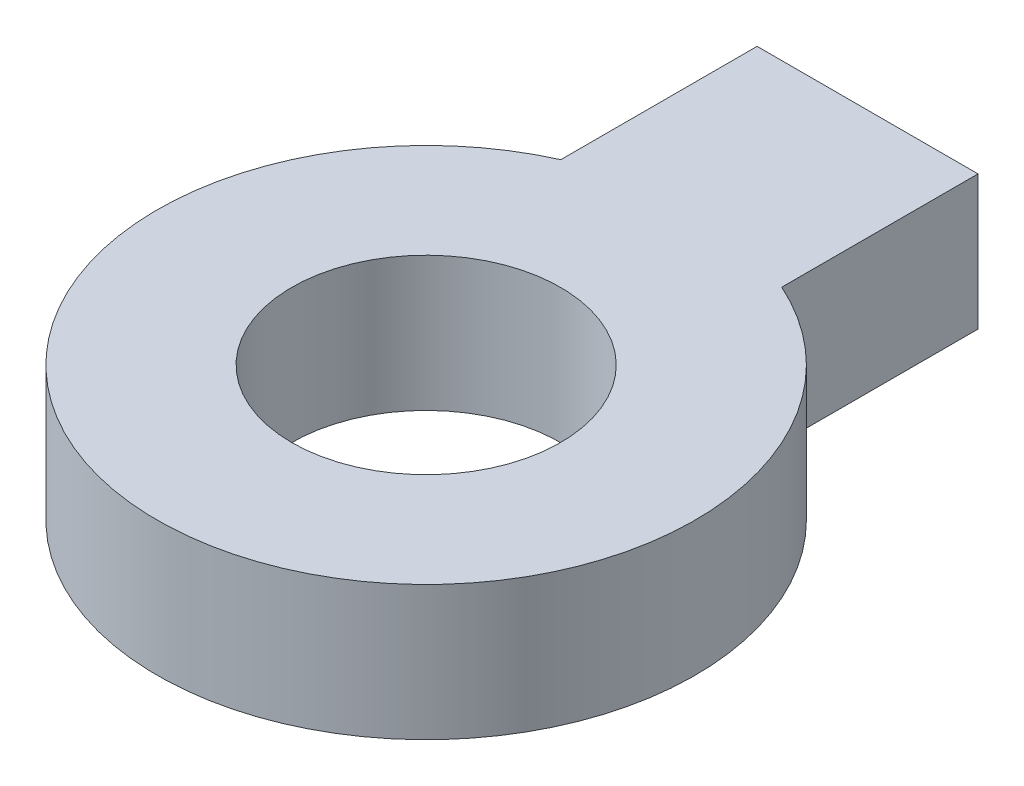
ISO-10303-21;
HEADER;
FILE_DESCRIPTION(('STEP AP214'),'2;1');
FILE_NAME('part.step','',(''),(''),'','','');
FILE_SCHEMA(('AUTOMOTIVE_DESIGN { 1 0 10303 214 1 1 1 1 }'));
ENDSEC;
DATA;
#1=APPLICATION_CONTEXT('core data for automotive mechanical design processes');
#2=APPLICATION_PROTOCOL_DEFINITION('international standard','automotive_design',2000,#1);
#3=PRODUCT_CONTEXT('',#1,'mechanical');
#4=PRODUCT('Part','Part','',(#3));
#5=PRODUCT_RELATED_PRODUCT_CATEGORY('part','',(#4));
#6=PRODUCT_DEFINITION_FORMATION('','',#4);
#7=PRODUCT_DEFINITION_CONTEXT('part definition',#1,'design');
#8=PRODUCT_DEFINITION('design','',#6,#7);
#9=PRODUCT_DEFINITION_SHAPE('','',#8);
#10=(LENGTH_UNIT() NAMED_UNIT(*) SI_UNIT(.MILLI.,.METRE.));
#11=(NAMED_UNIT(*) PLANE_ANGLE_UNIT() SI_UNIT($,.RADIAN.));
#12=(NAMED_UNIT(*) SI_UNIT($,.STERADIAN.) SOLID_ANGLE_UNIT());
#13=UNCERTAINTY_MEASURE_WITH_UNIT(LENGTH_MEASURE(1.E-05),#10,'distance_accuracy_value','');
#14=(GEOMETRIC_REPRESENTATION_CONTEXT(3) GLOBAL_UNCERTAINTY_ASSIGNED_CONTEXT((#13)) GLOBAL_UNIT_ASSIGNED_CONTEXT((#10,
#11,#12)) REPRESENTATION_CONTEXT('',''));
#15=CARTESIAN_POINT('',(0.,0.,0.));
#16=DIRECTION('',(0.,0.,1.));
#17=DIRECTION('',(1.,0.,0.));
#18=AXIS2_PLACEMENT_3D('',#15,#16,#17);
#19=CARTESIAN_POINT('',(0.,3.175,0.));
#20=DIRECTION('',(0.,1.,0.));
#21=DIRECTION('',(0.,0.,1.));
#22=AXIS2_PLACEMENT_3D('',#19,#20,#21);
#23=PLANE('',#22);
#24=CARTESIAN_POINT('',(0.,3.175,0.));
#25=DIRECTION('',(0.,1.,0.));
#26=DIRECTION('',(0.,0.,1.));
#27=AXIS2_PLACEMENT_3D('',#24,#25,#26);
#28=CIRCLE('',#27,6.35);
#29=CARTESIAN_POINT('',(-2.60851854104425,3.175,-5.78948452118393));
#30=VERTEX_POINT('',#29);
#31=CARTESIAN_POINT('',(2.60851854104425,3.175,-5.78948452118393));
#32=VERTEX_POINT('',#31);
#33=EDGE_CURVE('E85',#30,#32,#28,.T.);
#34=ORIENTED_EDGE('',*,*,#33,.T.);
#35=DIRECTION('',(0.,0.,-1.));
#36=VECTOR('',#35,1.);
#37=CARTESIAN_POINT('',(2.60851854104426,3.175,-10.4244218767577));
#38=LINE('',#37,#36);
#39=CARTESIAN_POINT('',(2.60851854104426,3.175,-10.4244218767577));
#40=VERTEX_POINT('',#39);
#41=EDGE_CURVE('E80',#32,#40,#38,.T.);
#42=ORIENTED_EDGE('',*,*,#41,.T.);
#43=DIRECTION('',(-1.,0.,0.));
#44=VECTOR('',#43,1.);
#45=CARTESIAN_POINT('',(-2.60851854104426,3.175,-10.4244218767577));
#46=LINE('',#45,#44);
#47=CARTESIAN_POINT('',(-2.60851854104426,3.175,-10.4244218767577));
#48=VERTEX_POINT('',#47);
#49=EDGE_CURVE('E83',#40,#48,#46,.T.);
#50=ORIENTED_EDGE('',*,*,#49,.T.);
#51=DIRECTION('',(0.,0.,1.));
#52=VECTOR('',#51,1.);
#53=CARTESIAN_POINT('',(-2.60851854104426,3.175,-10.4244218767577));
#54=LINE('',#53,#52);
#55=EDGE_CURVE('E50',#48,#30,#54,.T.);
#56=ORIENTED_EDGE('',*,*,#55,.T.);
#57=EDGE_LOOP('',(#34,#42,#50,#56));
#58=FACE_BOUND('',#57,.T.);
#59=CARTESIAN_POINT('',(0.,3.175,0.));
#60=DIRECTION('',(0.,1.,0.));
#61=DIRECTION('',(0.,0.,1.));
#62=AXIS2_PLACEMENT_3D('',#59,#60,#61);
#63=CIRCLE('',#62,3.175);
#64=CARTESIAN_POINT('',(0.,3.175,3.175));
#65=VERTEX_POINT('',#64);
#66=EDGE_CURVE('E100',#65,#65,#63,.T.);
#67=ORIENTED_EDGE('',*,*,#66,.F.);
#68=EDGE_LOOP('',(#67));
#69=FACE_BOUND('',#68,.T.);
#70=ADVANCED_FACE('F33',(#58,#69),#23,.T.);
#71=CARTESIAN_POINT('',(0.,0.,0.));
#72=DIRECTION('',(0.,1.,0.));
#73=DIRECTION('',(0.,0.,1.));
#74=AXIS2_PLACEMENT_3D('',#71,#72,#73);
#75=PLANE('',#74);
#76=CARTESIAN_POINT('',(0.,0.,0.));
#77=DIRECTION('',(0.,1.,0.));
#78=DIRECTION('',(0.,0.,1.));
#79=AXIS2_PLACEMENT_3D('',#76,#77,#78);
#80=CIRCLE('',#79,6.35);
#81=CARTESIAN_POINT('',(-2.60851854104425,0.,-5.78948452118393));
#82=VERTEX_POINT('',#81);
#83=CARTESIAN_POINT('',(2.60851854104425,0.,-5.78948452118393));
#84=VERTEX_POINT('',#83);
#85=EDGE_CURVE('E97',#82,#84,#80,.T.);
#86=ORIENTED_EDGE('',*,*,#85,.F.);
#87=DIRECTION('',(0.,0.,1.));
#88=VECTOR('',#87,1.);
#89=CARTESIAN_POINT('',(-2.60851854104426,0.,-10.4244218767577));
#90=LINE('',#89,#88);
#91=CARTESIAN_POINT('',(-2.60851854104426,0.,-10.4244218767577));
#92=VERTEX_POINT('',#91);
#93=EDGE_CURVE('E73',#92,#82,#90,.T.);
#94=ORIENTED_EDGE('',*,*,#93,.F.);
#95=DIRECTION('',(-1.,0.,0.));
#96=VECTOR('',#95,1.);
#97=CARTESIAN_POINT('',(-2.60851854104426,0.,-10.4244218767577));
#98=LINE('',#97,#96);
#99=CARTESIAN_POINT('',(2.60851854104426,0.,-10.4244218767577));
#100=VERTEX_POINT('',#99);
#101=EDGE_CURVE('E67',#100,#92,#98,.T.);
#102=ORIENTED_EDGE('',*,*,#101,.F.);
#103=DIRECTION('',(0.,0.,-1.));
#104=VECTOR('',#103,1.);
#105=CARTESIAN_POINT('',(2.60851854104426,0.,-10.4244218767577));
#106=LINE('',#105,#104);
#107=EDGE_CURVE('E89',#84,#100,#106,.T.);
#108=ORIENTED_EDGE('',*,*,#107,.F.);
#109=EDGE_LOOP('',(#86,#94,#102,#108));
#110=FACE_BOUND('',#109,.T.);
#111=CARTESIAN_POINT('',(0.,0.,0.));
#112=DIRECTION('',(0.,1.,0.));
#113=DIRECTION('',(0.,0.,1.));
#114=AXIS2_PLACEMENT_3D('',#111,#112,#113);
#115=CIRCLE('',#114,3.175);
#116=CARTESIAN_POINT('',(0.,0.,3.175));
#117=VERTEX_POINT('',#116);
#118=EDGE_CURVE('E112',#117,#117,#115,.T.);
#119=ORIENTED_EDGE('',*,*,#118,.T.);
#120=EDGE_LOOP('',(#119));
#121=FACE_BOUND('',#120,.T.);
#122=ADVANCED_FACE('F108',(#110,#121),#75,.F.);
#123=CARTESIAN_POINT('',(0.,3.175,0.));
#124=DIRECTION('',(0.,-1.,0.));
#125=DIRECTION('',(0.,0.,-1.));
#126=AXIS2_PLACEMENT_3D('',#123,#124,#125);
#127=CYLINDRICAL_SURFACE('',#126,6.35);
#128=ORIENTED_EDGE('',*,*,#85,.T.);
#129=DIRECTION('',(0.,-1.,0.));
#130=VECTOR('',#129,1.);
#131=CARTESIAN_POINT('',(2.60851854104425,3.175,-5.78948452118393));
#132=LINE('',#131,#130);
#133=EDGE_CURVE('E11',#32,#84,#132,.T.);
#134=ORIENTED_EDGE('',*,*,#133,.F.);
#135=ORIENTED_EDGE('',*,*,#33,.F.);
#136=DIRECTION('',(0.,-1.,0.));
#137=VECTOR('',#136,1.);
#138=CARTESIAN_POINT('',(-2.60851854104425,3.175,-5.78948452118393));
#139=LINE('',#138,#137);
#140=EDGE_CURVE('E93',#30,#82,#139,.T.);
#141=ORIENTED_EDGE('',*,*,#140,.T.);
#142=EDGE_LOOP('',(#128,#134,#135,#141));
#143=FACE_BOUND('',#142,.T.);
#144=ADVANCED_FACE('F35',(#143),#127,.T.);
#145=CARTESIAN_POINT('',(2.60851854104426,3.175,-10.4244218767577));
#146=DIRECTION('',(-1.,0.,0.));
#147=DIRECTION('',(0.,0.,1.));
#148=AXIS2_PLACEMENT_3D('',#145,#146,#147);
#149=PLANE('',#148);
#150=ORIENTED_EDGE('',*,*,#107,.T.);
#151=DIRECTION('',(0.,-1.,0.));
#152=VECTOR('',#151,1.);
#153=CARTESIAN_POINT('',(2.60851854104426,3.175,-10.4244218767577));
#154=LINE('',#153,#152);
#155=EDGE_CURVE('E42',#40,#100,#154,.T.);
#156=ORIENTED_EDGE('',*,*,#155,.F.);
#157=ORIENTED_EDGE('',*,*,#41,.F.);
#158=ORIENTED_EDGE('',*,*,#133,.T.);
#159=EDGE_LOOP('',(#150,#156,#157,#158));
#160=FACE_BOUND('',#159,.T.);
#161=ADVANCED_FACE('F88',(#160),#149,.F.);
#162=CARTESIAN_POINT('',(-2.60851854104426,3.175,-10.4244218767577));
#163=DIRECTION('',(0.,0.,1.));
#164=DIRECTION('',(1.,0.,0.));
#165=AXIS2_PLACEMENT_3D('',#162,#163,#164);
#166=PLANE('',#165);
#167=ORIENTED_EDGE('',*,*,#101,.T.);
#168=DIRECTION('',(0.,-1.,0.));
#169=VECTOR('',#168,1.);
#170=CARTESIAN_POINT('',(-2.60851854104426,3.175,-10.4244218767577));
#171=LINE('',#170,#169);
#172=EDGE_CURVE('E90',#48,#92,#171,.T.);
#173=ORIENTED_EDGE('',*,*,#172,.F.);
#174=ORIENTED_EDGE('',*,*,#49,.F.);
#175=ORIENTED_EDGE('',*,*,#155,.T.);
#176=EDGE_LOOP('',(#167,#173,#174,#175));
#177=FACE_BOUND('',#176,.T.);
#178=ADVANCED_FACE('F91',(#177),#166,.F.);
#179=CARTESIAN_POINT('',(-2.60851854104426,3.175,-10.4244218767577));
#180=DIRECTION('',(1.,0.,0.));
#181=DIRECTION('',(0.,0.,-1.));
#182=AXIS2_PLACEMENT_3D('',#179,#180,#181);
#183=PLANE('',#182);
#184=ORIENTED_EDGE('',*,*,#93,.T.);
#185=ORIENTED_EDGE('',*,*,#140,.F.);
#186=ORIENTED_EDGE('',*,*,#55,.F.);
#187=ORIENTED_EDGE('',*,*,#172,.T.);
#188=EDGE_LOOP('',(#184,#185,#186,#187));
#189=FACE_BOUND('',#188,.T.);
#190=ADVANCED_FACE('F105',(#189),#183,.F.);
#191=CARTESIAN_POINT('',(0.,3.175,0.));
#192=DIRECTION('',(0.,-1.,0.));
#193=DIRECTION('',(0.,0.,-1.));
#194=AXIS2_PLACEMENT_3D('',#191,#192,#193);
#195=CYLINDRICAL_SURFACE('',#194,3.175);
#196=ORIENTED_EDGE('',*,*,#66,.T.);
#197=EDGE_LOOP('',(#196));
#198=FACE_BOUND('',#197,.T.);
#199=ORIENTED_EDGE('',*,*,#118,.F.);
#200=EDGE_LOOP('',(#199));
#201=FACE_BOUND('',#200,.T.);
#202=ADVANCED_FACE('F118',(#198,#201),#195,.F.);
#203=CLOSED_SHELL('',(#70,#122,#144,#161,#178,#190,#202));
#204=MANIFOLD_SOLID_BREP('B2',#203);
#205=ADVANCED_BREP_SHAPE_REPRESENTATION('',(#18,#204),#14);
#206=SHAPE_DEFINITION_REPRESENTATION(#9,#205);
ENDSEC;
END-ISO-10303-21;
